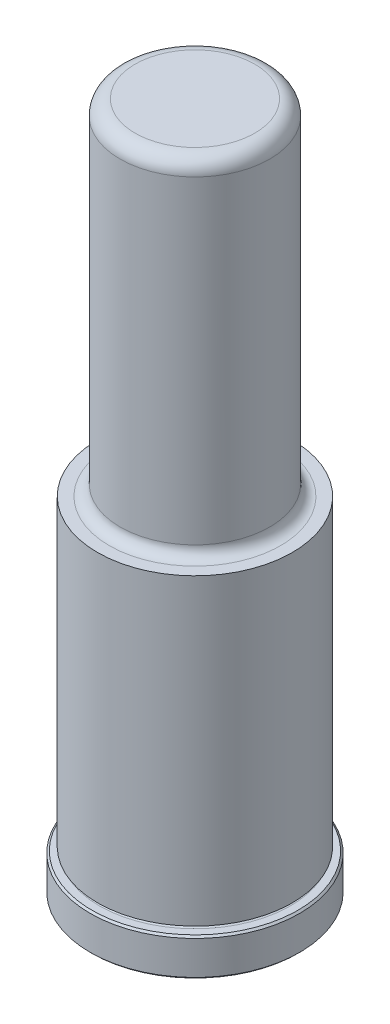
from build123d import *

# Parameters (mm, degrees)
CHAMFER1_SIZE = 0.381
FILLET7_R     = 3.175


with BuildPart() as part:
    # Sketch1 → Revolve1 (revolve)
    with BuildSketch(Plane(origin=(0, 0, 0), x_dir=(0, 0, -1), z_dir=(1, 0, 0)), mode=Mode.PRIVATE) as revolve1_sk:
        with BuildLine():
            Line((0, 0), (22.225, 0))
            Line((22.225, 0), (22.225, 7.9248))
            Line((22.225, 7.9248), (20.2438, 7.9248))
            ThreePointArc((20.2438, 7.9248), (19.8628, 8.3058), (20.2438, 8.6868))
            Line((20.2438, 8.6868), (20.6502, 8.6868))
            Line((20.6502, 8.6868), (20.6502, 73.025))
            Line((20.6502, 73.025), (18.1483, 73.025))
            ThreePointArc((18.1483, 73.025), (16.531853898, 73.694553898), (15.8623, 75.311))
            Line((15.8623, 75.311), (15.8623, 146.05))
            Line((15.8623, 146.05), (0, 146.05))
            Line((0, 146.05), (0, 0))
        make_face()
    revolve(revolve1_sk.sketch.rotate(Axis((0, 0, 0), (0, -1, 0)), 180), axis=Axis((0, 0, 0), (0, -1, 0)))

    # Chamfer1
    chamfer1_edges = [part.edges().sort_by_distance(p)[0] for p in [
        (0, 7.9248, -22.225),
        (0, 0, -22.225),
    ]]
    chamfer(chamfer1_edges, length=CHAMFER1_SIZE)

    # Fillet7
    fillet7_edges = [part.edges().sort_by_distance(p)[0] for p in [
        (0, 146.05, -15.8623),
    ]]
    fillet(fillet7_edges, radius=FILLET7_R)


solid = part.part
